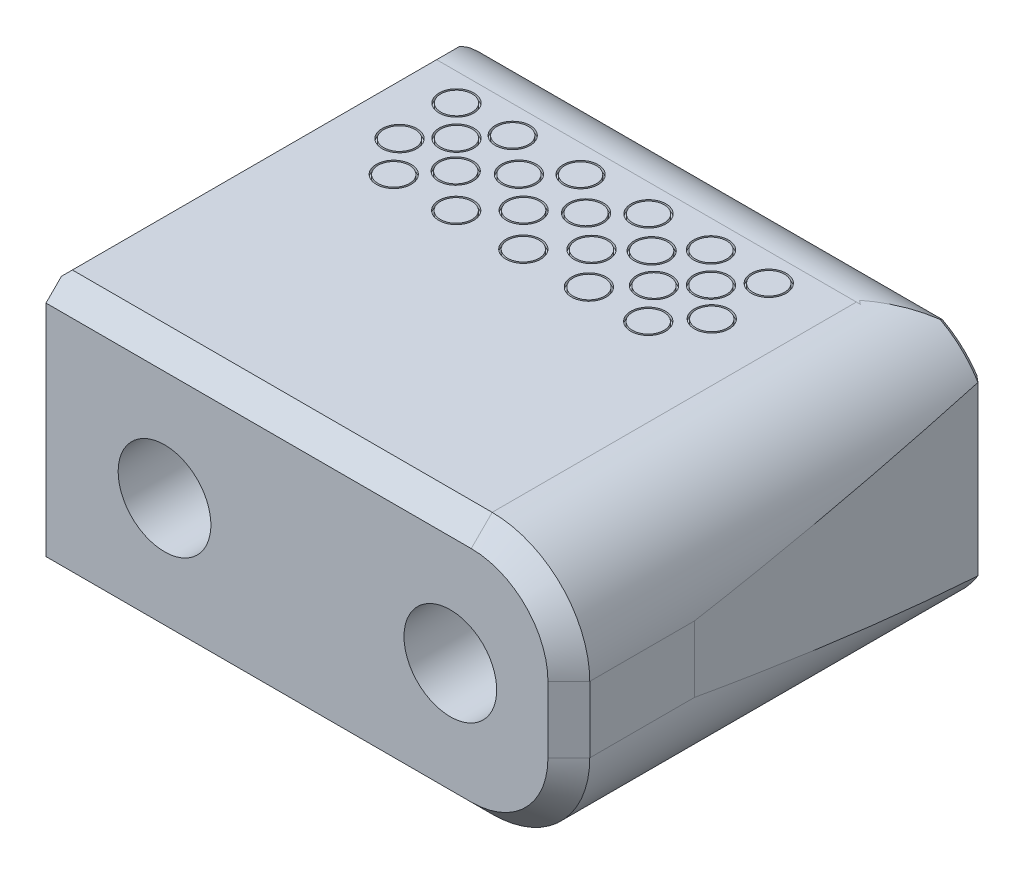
from build123d import *

# Parameters (mm, degrees)
SKETCH3_W                  = 31.242
SKETCH3_H                  = 19.05
EXTRUDE1_DEPTH             = 38.1
F_1_4_20_CBORE_D           = 6.7564
F_1_4_20_CBORE_CBORE_D     = 11.1125
F_1_4_20_CBORE_CBORE_DEPTH = 7.62
FILLET1_R                  = 7.112
CHAMFER1_SIZE              = 0.396875
CHAMFER2_SIZE              = 1.524
CUT_EXTRUDE2_DEPTH         = 51.183644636
CUT_EXTRUDE1_DEPTH         = 12.5
CHAMFER3_SIZE              = 0.396875
CHAMFER3_SIZE2             = 0.441634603
CHAMFER4_SIZE              = 0.396875
SKETCH9_R                  = 1.27
SKETCH9_R_2                = 1.143
CUT_EXTRUDE3_DEPTH         = 0.254


with BuildPart() as part:
    # Sketch3 → Extrude1 (new body)
    with BuildSketch(Plane(origin=(0, 0, 0), x_dir=(0, 0, -1), z_dir=(1, 0, 0))):
        with Locations((15.621, 0)):
            Rectangle(SKETCH3_W, SKETCH3_H)
    extrude(amount=EXTRUDE1_DEPTH)

    # 1_4_-20 CBORE (through all)
    with Locations(Plane(origin=(0, 0, -31.242), x_dir=(-1, 0, 0), z_dir=(0, 0, -1))):
        with Locations((-8.636, 0), (-29.464, 0)):
            CounterBoreHole(F_1_4_20_CBORE_D / 2, F_1_4_20_CBORE_CBORE_D / 2, F_1_4_20_CBORE_CBORE_DEPTH)

    # Fillet1
    fillet1_edges = [part.edges().sort_by_distance(p)[0] for p in [
        (38.1, 9.525, -15.621),
        (38.1, -9.525, -15.621),
    ]]
    fillet(fillet1_edges, radius=FILLET1_R)

    # Chamfer1
    chamfer1_edges = [part.edges().sort_by_distance(p)[0] for p in [
        (38.1, 0, -31.242),
        (15.494, 9.525, -31.242),
        (15.494, -9.525, -31.242),
        (36.016943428, 7.441943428, -31.242),
        (36.016943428, -7.441943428, -31.242),
    ]]
    chamfer(chamfer1_edges, length=CHAMFER1_SIZE)

    # Chamfer2
    chamfer2_edges = [part.edges().sort_by_distance(p)[0] for p in [
        (38.1, 0, 0),
        (15.494, -9.525, 0),
        (15.494, 9.525, 0),
        (36.016943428, 7.441943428, 0),
        (36.016943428, -7.441943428, 0),
    ]]
    chamfer(chamfer2_edges, length=CHAMFER2_SIZE)

    # Sketch8 → Cut-Extrude2 (cut, through all)
    with BuildSketch(Plane.ZY):
        with BuildLine():
            Line((-31.242, -8.376335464), (-40.767, -8.376335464))
            Line((-40.767, -8.376335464), (-40.767, -22.219335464))
            Line((-40.767, -22.219335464), (-28.067, -22.219335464))
            Line((-28.067, -22.219335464), (-28.067, -9.519335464))
            ThreePointArc((-28.067, -9.519335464), (-29.769302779, -9.266732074), (-31.242, -8.376335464))
        make_face()
        with BuildLine():
            Line((-40.767, 22.219335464), (-40.767, 8.376335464))
            Line((-40.767, 8.376335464), (-31.242, 8.376335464))
            ThreePointArc((-31.242, 8.376335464), (-29.769302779, 9.266732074), (-28.067, 9.519335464))
            Line((-28.067, 9.519335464), (-28.067, 22.219335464))
            Line((-28.067, 22.219335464), (-40.767, 22.219335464))
        make_face()
    extrude(amount=-CUT_EXTRUDE2_DEPTH, mode=Mode.SUBTRACT)

    # Sketch5 → Cut-Extrude1 (cut, symmetric)
    with BuildSketch(Plane(origin=(0, 0, 0), x_dir=(1, 0, 0), z_dir=(0, 1, 0))):
        with BuildLine():
            Line((38.1, 9.144), (50.8, 9.144))
            Line((50.8, 9.144), (50.8, 34.544))
            Line((50.8, 34.544), (36.684506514, 34.544))
            ThreePointArc((36.684506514, 34.544), (37.745852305, 21.8637054), (38.1, 9.144))
        make_face()
    extrude(amount=CUT_EXTRUDE1_DEPTH, both=True, mode=Mode.SUBTRACT)

    # Chamfer3
    chamfer3_edges = [part.edges().sort_by_distance(p)[0] for p in [
        (37.029423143, 0, -31.242),
    ]]
    chamfer3_side = [part.faces().sort_by_distance(p)[0] for p in [
        (37.832198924, 0, -20.2059589),
    ]]
    chamfer(chamfer3_edges, length=CHAMFER3_SIZE, length2=CHAMFER3_SIZE2, reference=chamfer3_side[0])

    # Chamfer4
    chamfer4_edges = [part.edges().sort_by_distance(p)[0] for p in [
        (0, -9.525, -14.7955),
        (0, 9.525, -14.7955),
        (0, 0, -31.242),
    ]]
    chamfer(chamfer4_edges, length=CHAMFER4_SIZE)

    # Sketch9 → Cut-Extrude3 (cut)
    # profile 1 of 22: a face of its own
    with BuildSketch(Plane(origin=(0, 9.525, 0), x_dir=(1, 0, 0), z_dir=(0, 1, 0))):
        with Locations(Location((7.951642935, 26.056694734, 0), (0, 0, 270))):
            Circle(SKETCH9_R)
        with Locations(Location((7.951642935, 26.056694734, 0), (0, 0, 270))):
            Circle(SKETCH9_R_2, mode=Mode.SUBTRACT)
    # profile 2 of 22: a face of its own
    with BuildSketch(Plane(origin=(0, 9.525, 0), x_dir=(1, 0, 0), z_dir=(0, 1, 0))):
        with Locations(Location((12.900632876, 26.056694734, 0), (0, 0, 270))):
            Circle(SKETCH9_R)
        with Locations(Location((12.900632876, 26.056694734, 0), (0, 0, 270))):
            Circle(SKETCH9_R_2, mode=Mode.SUBTRACT)
    # profile 3 of 22: a face of its own
    with BuildSketch(Plane(origin=(0, 9.525, 0), x_dir=(1, 0, 0), z_dir=(0, 1, 0))):
        with Locations(Location((17.849622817, 26.056694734, 0), (0, 0, 270))):
            Circle(SKETCH9_R)
        with Locations(Location((17.849622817, 26.056694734, 0), (0, 0, 270))):
            Circle(SKETCH9_R_2, mode=Mode.SUBTRACT)
    # profile 4 of 22: a face of its own
    with BuildSketch(Plane(origin=(0, 9.525, 0), x_dir=(1, 0, 0), z_dir=(0, 1, 0))):
        with Locations(Location((22.400418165, 26.056694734, 0), (0, 0, 270))):
            Circle(SKETCH9_R)
        with Locations(Location((22.400418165, 26.056694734, 0), (0, 0, 270))):
            Circle(SKETCH9_R_2, mode=Mode.SUBTRACT)
    # profile 5 of 22: a face of its own
    with BuildSketch(Plane(origin=(0, 9.525, 0), x_dir=(1, 0, 0), z_dir=(0, 1, 0))):
        with Locations(Location((26.609903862, 26.056694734, 0), (0, 0, 270))):
            Circle(SKETCH9_R)
        with Locations(Location((26.609903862, 26.056694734, 0), (0, 0, 270))):
            Circle(SKETCH9_R_2, mode=Mode.SUBTRACT)
    # profile 6 of 22: a face of its own
    with BuildSketch(Plane(origin=(0, 9.525, 0), x_dir=(1, 0, 0), z_dir=(0, 1, 0))):
        with Locations(Location((10.625235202, 23.838182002, 0), (0, 0, 270))):
            Circle(SKETCH9_R)
        with Locations(Location((10.625235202, 23.838182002, 0), (0, 0, 270))):
            Circle(SKETCH9_R_2, mode=Mode.SUBTRACT)
    # profile 7 of 22: a face of its own
    with BuildSketch(Plane(origin=(0, 9.525, 0), x_dir=(1, 0, 0), z_dir=(0, 1, 0))):
        with Locations(Location((15.517340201, 23.838182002, 0), (0, 0, 270))):
            Circle(SKETCH9_R)
        with Locations(Location((15.517340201, 23.838182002, 0), (0, 0, 270))):
            Circle(SKETCH9_R_2, mode=Mode.SUBTRACT)
    # profile 8 of 22: a face of its own
    with BuildSketch(Plane(origin=(0, 9.525, 0), x_dir=(1, 0, 0), z_dir=(0, 1, 0))):
        with Locations(Location((20.295675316, 23.838182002, 0), (0, 0, 270))):
            Circle(SKETCH9_R)
        with Locations(Location((20.295675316, 23.838182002, 0), (0, 0, 270))):
            Circle(SKETCH9_R_2, mode=Mode.SUBTRACT)
    # profile 9 of 22: a face of its own
    with BuildSketch(Plane(origin=(0, 9.525, 0), x_dir=(1, 0, 0), z_dir=(0, 1, 0))):
        with Locations(Location((24.618930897, 23.838182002, 0), (0, 0, 270))):
            Circle(SKETCH9_R)
        with Locations(Location((24.618930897, 23.838182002, 0), (0, 0, 270))):
            Circle(SKETCH9_R_2, mode=Mode.SUBTRACT)
    # profile 10 of 22: a face of its own
    with BuildSketch(Plane(origin=(0, 9.525, 0), x_dir=(1, 0, 0), z_dir=(0, 1, 0))):
        with Locations(Location((8.122297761, 21.733439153, 0), (0, 0, 270))):
            Circle(SKETCH9_R)
        with Locations(Location((8.122297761, 21.733439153, 0), (0, 0, 270))):
            Circle(SKETCH9_R_2, mode=Mode.SUBTRACT)
    # profile 11 of 22: a face of its own
    with BuildSketch(Plane(origin=(0, 9.525, 0), x_dir=(1, 0, 0), z_dir=(0, 1, 0))):
        with Locations(Location((6.074439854, 23.838182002, 0), (0, 0, 270))):
            Circle(SKETCH9_R)
        with Locations(Location((6.074439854, 23.838182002, 0), (0, 0, 270))):
            Circle(SKETCH9_R_2, mode=Mode.SUBTRACT)
    # profile 12 of 22: a face of its own
    with BuildSketch(Plane(origin=(0, 9.525, 0), x_dir=(1, 0, 0), z_dir=(0, 1, 0))):
        with Locations(Location((13.071287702, 21.733439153, 0), (0, 0, 270))):
            Circle(SKETCH9_R)
        with Locations(Location((13.071287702, 21.733439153, 0), (0, 0, 270))):
            Circle(SKETCH9_R_2, mode=Mode.SUBTRACT)
    # profile 13 of 22: a face of its own
    with BuildSketch(Plane(origin=(0, 9.525, 0), x_dir=(1, 0, 0), z_dir=(0, 1, 0))):
        with Locations(Location((18.020277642, 21.733439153, 0), (0, 0, 270))):
            Circle(SKETCH9_R)
        with Locations(Location((18.020277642, 21.733439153, 0), (0, 0, 270))):
            Circle(SKETCH9_R_2, mode=Mode.SUBTRACT)
    # profile 14 of 22: a face of its own
    with BuildSketch(Plane(origin=(0, 9.525, 0), x_dir=(1, 0, 0), z_dir=(0, 1, 0))):
        with Locations(Location((3.855927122, 26.056694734, 0), (0, 0, 270))):
            Circle(SKETCH9_R)
        with Locations(Location((3.855927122, 26.056694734, 0), (0, 0, 270))):
            Circle(SKETCH9_R_2, mode=Mode.SUBTRACT)
    # profile 15 of 22: a face of its own
    with BuildSketch(Plane(origin=(0, 9.525, 0), x_dir=(1, 0, 0), z_dir=(0, 1, 0))):
        with Locations(Location((22.57107299, 21.733439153, 0), (0, 0, 270))):
            Circle(SKETCH9_R)
        with Locations(Location((22.57107299, 21.733439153, 0), (0, 0, 270))):
            Circle(SKETCH9_R_2, mode=Mode.SUBTRACT)
    # profile 16 of 22: a face of its own
    with BuildSketch(Plane(origin=(0, 9.525, 0), x_dir=(1, 0, 0), z_dir=(0, 1, 0))):
        with Locations(Location((26.780558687, 21.733439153, 0), (0, 0, 270))):
            Circle(SKETCH9_R)
        with Locations(Location((26.780558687, 21.733439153, 0), (0, 0, 270))):
            Circle(SKETCH9_R_2, mode=Mode.SUBTRACT)
    # profile 17 of 22: a face of its own
    with BuildSketch(Plane(origin=(0, 9.525, 0), x_dir=(1, 0, 0), z_dir=(0, 1, 0))):
        with Locations(Location((4.026581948, 21.733439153, 0), (0, 0, 270))):
            Circle(SKETCH9_R)
        with Locations(Location((4.026581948, 21.733439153, 0), (0, 0, 270))):
            Circle(SKETCH9_R_2, mode=Mode.SUBTRACT)
    # profile 18 of 22: a face of its own
    with BuildSketch(Plane(origin=(0, 9.525, 0), x_dir=(1, 0, 0), z_dir=(0, 1, 0))):
        with Locations(Location((10.625235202, 19.266182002, 0), (0, 0, 270))):
            Circle(SKETCH9_R)
        with Locations(Location((10.625235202, 19.266182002, 0), (0, 0, 270))):
            Circle(SKETCH9_R_2, mode=Mode.SUBTRACT)
    # profile 19 of 22: a face of its own
    with BuildSketch(Plane(origin=(0, 9.525, 0), x_dir=(1, 0, 0), z_dir=(0, 1, 0))):
        with Locations(Location((15.517340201, 19.266182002, 0), (0, 0, 270))):
            Circle(SKETCH9_R)
        with Locations(Location((15.517340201, 19.266182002, 0), (0, 0, 270))):
            Circle(SKETCH9_R_2, mode=Mode.SUBTRACT)
    # profile 20 of 22: a face of its own
    with BuildSketch(Plane(origin=(0, 9.525, 0), x_dir=(1, 0, 0), z_dir=(0, 1, 0))):
        with Locations(Location((20.295675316, 19.266182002, 0), (0, 0, 270))):
            Circle(SKETCH9_R)
        with Locations(Location((20.295675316, 19.266182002, 0), (0, 0, 270))):
            Circle(SKETCH9_R_2, mode=Mode.SUBTRACT)
    # profile 21 of 22: a face of its own
    with BuildSketch(Plane(origin=(0, 9.525, 0), x_dir=(1, 0, 0), z_dir=(0, 1, 0))):
        with Locations(Location((24.618930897, 19.266182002, 0), (0, 0, 270))):
            Circle(SKETCH9_R)
        with Locations(Location((24.618930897, 19.266182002, 0), (0, 0, 270))):
            Circle(SKETCH9_R_2, mode=Mode.SUBTRACT)
    # profile 22 of 22: a face of its own
    with BuildSketch(Plane(origin=(0, 9.525, 0), x_dir=(1, 0, 0), z_dir=(0, 1, 0))):
        with Locations(Location((6.074439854, 19.266182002, 0), (0, 0, 270))):
            Circle(SKETCH9_R)
        with Locations(Location((6.074439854, 19.266182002, 0), (0, 0, 270))):
            Circle(SKETCH9_R_2, mode=Mode.SUBTRACT)
    cut_extrude3 = extrude(amount=-CUT_EXTRUDE3_DEPTH, mode=Mode.SUBTRACT)

    # Mirror3: Cut-Extrude3 across plane
    add(cut_extrude3.mirror(Plane.ZX), mode=Mode.SUBTRACT)


solid = part.part
